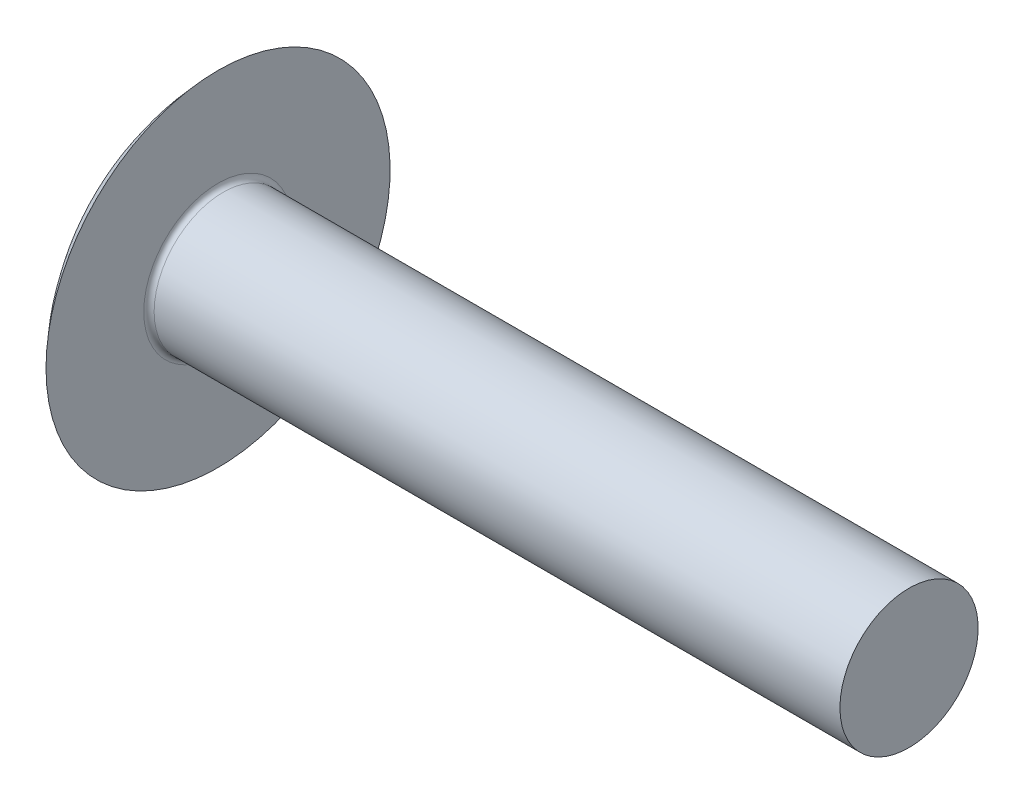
from build123d import *


with BuildPart() as part:
    # Sketch1 → Base-Revolve (revolve)
    with BuildSketch(Plane.XY, mode=Mode.PRIVATE) as base_revolve_sk:
        with BuildLine():
            Line((43.962049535, 0), (43.962049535, 4))
            Line((43.962049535, 4), (4.262049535, 4))
            ThreePointArc((4.262049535, 4), (4.049917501, 4.087867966), (3.962049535, 4.3))
            Line((3.962049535, 4.3), (3.962049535, 9.96))
            ThreePointArc((3.962049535, 9.96), (1.026873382, 5.359557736), (0, 0))
            Line((0, 0), (43.962049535, 0))
        make_face()
    revolve(base_revolve_sk.sketch.rotate(Axis((-60.094413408, 0, 0), (1, 0, 0)), 90), axis=Axis((-60.094413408, 0, 0), (1, 0, 0)))


solid = part.part
